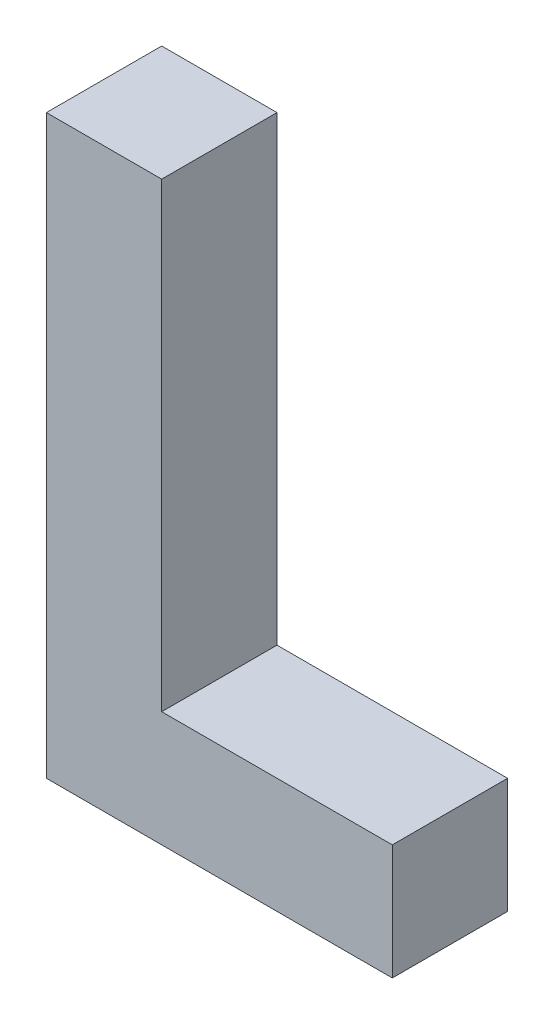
ISO-10303-21;
HEADER;
FILE_DESCRIPTION(('STEP AP214'),'2;1');
FILE_NAME('part.step','',(''),(''),'','','');
FILE_SCHEMA(('AUTOMOTIVE_DESIGN { 1 0 10303 214 1 1 1 1 }'));
ENDSEC;
DATA;
#1=APPLICATION_CONTEXT('core data for automotive mechanical design processes');
#2=APPLICATION_PROTOCOL_DEFINITION('international standard','automotive_design',2000,#1);
#3=PRODUCT_CONTEXT('',#1,'mechanical');
#4=PRODUCT('Part','Part','',(#3));
#5=PRODUCT_RELATED_PRODUCT_CATEGORY('part','',(#4));
#6=PRODUCT_DEFINITION_FORMATION('','',#4);
#7=PRODUCT_DEFINITION_CONTEXT('part definition',#1,'design');
#8=PRODUCT_DEFINITION('design','',#6,#7);
#9=PRODUCT_DEFINITION_SHAPE('','',#8);
#10=(LENGTH_UNIT() NAMED_UNIT(*) SI_UNIT(.MILLI.,.METRE.));
#11=(NAMED_UNIT(*) PLANE_ANGLE_UNIT() SI_UNIT($,.RADIAN.));
#12=(NAMED_UNIT(*) SI_UNIT($,.STERADIAN.) SOLID_ANGLE_UNIT());
#13=UNCERTAINTY_MEASURE_WITH_UNIT(LENGTH_MEASURE(1.E-05),#10,'distance_accuracy_value','');
#14=(GEOMETRIC_REPRESENTATION_CONTEXT(3) GLOBAL_UNCERTAINTY_ASSIGNED_CONTEXT((#13)) GLOBAL_UNIT_ASSIGNED_CONTEXT((#10,
#11,#12)) REPRESENTATION_CONTEXT('',''));
#15=CARTESIAN_POINT('',(0.,0.,0.));
#16=DIRECTION('',(0.,0.,1.));
#17=DIRECTION('',(1.,0.,0.));
#18=AXIS2_PLACEMENT_3D('',#15,#16,#17);
#19=CARTESIAN_POINT('',(0.,0.,10.));
#20=DIRECTION('',(0.,1.,0.));
#21=DIRECTION('',(0.,0.,1.));
#22=AXIS2_PLACEMENT_3D('',#19,#20,#21);
#23=PLANE('',#22);
#24=DIRECTION('',(1.,0.,0.));
#25=VECTOR('',#24,1.);
#26=CARTESIAN_POINT('',(0.,0.,0.));
#27=LINE('',#26,#25);
#28=CARTESIAN_POINT('',(0.,0.,0.));
#29=VERTEX_POINT('',#28);
#30=CARTESIAN_POINT('',(30.,0.,0.));
#31=VERTEX_POINT('',#30);
#32=EDGE_CURVE('E121',#29,#31,#27,.T.);
#33=ORIENTED_EDGE('',*,*,#32,.T.);
#34=DIRECTION('',(0.,0.,-1.));
#35=VECTOR('',#34,1.);
#36=CARTESIAN_POINT('',(30.,0.,10.));
#37=LINE('',#36,#35);
#38=CARTESIAN_POINT('',(30.,0.,10.));
#39=VERTEX_POINT('',#38);
#40=EDGE_CURVE('E41',#39,#31,#37,.T.);
#41=ORIENTED_EDGE('',*,*,#40,.F.);
#42=DIRECTION('',(1.,0.,0.));
#43=VECTOR('',#42,1.);
#44=CARTESIAN_POINT('',(0.,0.,10.));
#45=LINE('',#44,#43);
#46=CARTESIAN_POINT('',(0.,0.,10.));
#47=VERTEX_POINT('',#46);
#48=EDGE_CURVE('E87',#47,#39,#45,.T.);
#49=ORIENTED_EDGE('',*,*,#48,.F.);
#50=DIRECTION('',(0.,0.,-1.));
#51=VECTOR('',#50,1.);
#52=CARTESIAN_POINT('',(0.,0.,10.));
#53=LINE('',#52,#51);
#54=EDGE_CURVE('E11',#47,#29,#53,.T.);
#55=ORIENTED_EDGE('',*,*,#54,.T.);
#56=EDGE_LOOP('',(#33,#41,#49,#55));
#57=FACE_BOUND('',#56,.T.);
#58=ADVANCED_FACE('F33',(#57),#23,.F.);
#59=CARTESIAN_POINT('',(30.,0.,10.));
#60=DIRECTION('',(-1.,0.,0.));
#61=DIRECTION('',(0.,0.,1.));
#62=AXIS2_PLACEMENT_3D('',#59,#60,#61);
#63=PLANE('',#62);
#64=DIRECTION('',(0.,1.,0.));
#65=VECTOR('',#64,1.);
#66=CARTESIAN_POINT('',(30.,0.,0.));
#67=LINE('',#66,#65);
#68=CARTESIAN_POINT('',(30.,10.,0.));
#69=VERTEX_POINT('',#68);
#70=EDGE_CURVE('E123',#31,#69,#67,.T.);
#71=ORIENTED_EDGE('',*,*,#70,.T.);
#72=DIRECTION('',(0.,0.,-1.));
#73=VECTOR('',#72,1.);
#74=CARTESIAN_POINT('',(30.,10.,10.));
#75=LINE('',#74,#73);
#76=CARTESIAN_POINT('',(30.,10.,10.));
#77=VERTEX_POINT('',#76);
#78=EDGE_CURVE('E110',#77,#69,#75,.T.);
#79=ORIENTED_EDGE('',*,*,#78,.F.);
#80=DIRECTION('',(0.,1.,0.));
#81=VECTOR('',#80,1.);
#82=CARTESIAN_POINT('',(30.,0.,10.));
#83=LINE('',#82,#81);
#84=EDGE_CURVE('E101',#39,#77,#83,.T.);
#85=ORIENTED_EDGE('',*,*,#84,.F.);
#86=ORIENTED_EDGE('',*,*,#40,.T.);
#87=EDGE_LOOP('',(#71,#79,#85,#86));
#88=FACE_BOUND('',#87,.T.);
#89=ADVANCED_FACE('F135',(#88),#63,.F.);
#90=CARTESIAN_POINT('',(10.,10.,10.));
#91=DIRECTION('',(0.,-1.,0.));
#92=DIRECTION('',(0.,0.,-1.));
#93=AXIS2_PLACEMENT_3D('',#90,#91,#92);
#94=PLANE('',#93);
#95=DIRECTION('',(-1.,0.,0.));
#96=VECTOR('',#95,1.);
#97=CARTESIAN_POINT('',(10.,10.,0.));
#98=LINE('',#97,#96);
#99=CARTESIAN_POINT('',(10.,10.,0.));
#100=VERTEX_POINT('',#99);
#101=EDGE_CURVE('E109',#69,#100,#98,.T.);
#102=ORIENTED_EDGE('',*,*,#101,.T.);
#103=DIRECTION('',(0.,0.,-1.));
#104=VECTOR('',#103,1.);
#105=CARTESIAN_POINT('',(10.,10.,10.));
#106=LINE('',#105,#104);
#107=CARTESIAN_POINT('',(10.,10.,10.));
#108=VERTEX_POINT('',#107);
#109=EDGE_CURVE('E106',#108,#100,#106,.T.);
#110=ORIENTED_EDGE('',*,*,#109,.F.);
#111=DIRECTION('',(-1.,0.,0.));
#112=VECTOR('',#111,1.);
#113=CARTESIAN_POINT('',(10.,10.,10.));
#114=LINE('',#113,#112);
#115=EDGE_CURVE('E95',#77,#108,#114,.T.);
#116=ORIENTED_EDGE('',*,*,#115,.F.);
#117=ORIENTED_EDGE('',*,*,#78,.T.);
#118=EDGE_LOOP('',(#102,#110,#116,#117));
#119=FACE_BOUND('',#118,.T.);
#120=ADVANCED_FACE('F107',(#119),#94,.F.);
#121=CARTESIAN_POINT('',(10.,10.,10.));
#122=DIRECTION('',(-1.,0.,0.));
#123=DIRECTION('',(0.,0.,1.));
#124=AXIS2_PLACEMENT_3D('',#121,#122,#123);
#125=PLANE('',#124);
#126=DIRECTION('',(0.,1.,0.));
#127=VECTOR('',#126,1.);
#128=CARTESIAN_POINT('',(10.,10.,0.));
#129=LINE('',#128,#127);
#130=CARTESIAN_POINT('',(10.,50.,0.));
#131=VERTEX_POINT('',#130);
#132=EDGE_CURVE('E73',#100,#131,#129,.T.);
#133=ORIENTED_EDGE('',*,*,#132,.T.);
#134=DIRECTION('',(0.,0.,-1.));
#135=VECTOR('',#134,1.);
#136=CARTESIAN_POINT('',(10.,50.,10.));
#137=LINE('',#136,#135);
#138=CARTESIAN_POINT('',(10.,50.,10.));
#139=VERTEX_POINT('',#138);
#140=EDGE_CURVE('E111',#139,#131,#137,.T.);
#141=ORIENTED_EDGE('',*,*,#140,.F.);
#142=DIRECTION('',(0.,1.,0.));
#143=VECTOR('',#142,1.);
#144=CARTESIAN_POINT('',(10.,10.,10.));
#145=LINE('',#144,#143);
#146=EDGE_CURVE('E99',#108,#139,#145,.T.);
#147=ORIENTED_EDGE('',*,*,#146,.F.);
#148=ORIENTED_EDGE('',*,*,#109,.T.);
#149=EDGE_LOOP('',(#133,#141,#147,#148));
#150=FACE_BOUND('',#149,.T.);
#151=ADVANCED_FACE('F113',(#150),#125,.F.);
#152=CARTESIAN_POINT('',(0.,50.,10.));
#153=DIRECTION('',(0.,-1.,0.));
#154=DIRECTION('',(0.,0.,-1.));
#155=AXIS2_PLACEMENT_3D('',#152,#153,#154);
#156=PLANE('',#155);
#157=DIRECTION('',(-1.,0.,0.));
#158=VECTOR('',#157,1.);
#159=CARTESIAN_POINT('',(0.,50.,0.));
#160=LINE('',#159,#158);
#161=CARTESIAN_POINT('',(0.,50.,0.));
#162=VERTEX_POINT('',#161);
#163=EDGE_CURVE('E80',#131,#162,#160,.T.);
#164=ORIENTED_EDGE('',*,*,#163,.T.);
#165=DIRECTION('',(0.,0.,-1.));
#166=VECTOR('',#165,1.);
#167=CARTESIAN_POINT('',(0.,50.,10.));
#168=LINE('',#167,#166);
#169=CARTESIAN_POINT('',(0.,50.,10.));
#170=VERTEX_POINT('',#169);
#171=EDGE_CURVE('E117',#170,#162,#168,.T.);
#172=ORIENTED_EDGE('',*,*,#171,.F.);
#173=DIRECTION('',(-1.,0.,0.));
#174=VECTOR('',#173,1.);
#175=CARTESIAN_POINT('',(0.,50.,10.));
#176=LINE('',#175,#174);
#177=EDGE_CURVE('E115',#139,#170,#176,.T.);
#178=ORIENTED_EDGE('',*,*,#177,.F.);
#179=ORIENTED_EDGE('',*,*,#140,.T.);
#180=EDGE_LOOP('',(#164,#172,#178,#179));
#181=FACE_BOUND('',#180,.T.);
#182=ADVANCED_FACE('F141',(#181),#156,.F.);
#183=CARTESIAN_POINT('',(0.,10.,10.));
#184=DIRECTION('',(1.,0.,0.));
#185=DIRECTION('',(0.,0.,-1.));
#186=AXIS2_PLACEMENT_3D('',#183,#184,#185);
#187=PLANE('',#186);
#188=DIRECTION('',(0.,-1.,0.));
#189=VECTOR('',#188,1.);
#190=CARTESIAN_POINT('',(0.,10.,0.));
#191=LINE('',#190,#189);
#192=EDGE_CURVE('E128',#162,#29,#191,.T.);
#193=ORIENTED_EDGE('',*,*,#192,.T.);
#194=ORIENTED_EDGE('',*,*,#54,.F.);
#195=DIRECTION('',(0.,-1.,0.));
#196=VECTOR('',#195,1.);
#197=CARTESIAN_POINT('',(0.,0.,10.));
#198=LINE('',#197,#196);
#199=EDGE_CURVE('E49',#170,#47,#198,.T.);
#200=ORIENTED_EDGE('',*,*,#199,.F.);
#201=ORIENTED_EDGE('',*,*,#171,.T.);
#202=EDGE_LOOP('',(#193,#194,#200,#201));
#203=FACE_BOUND('',#202,.T.);
#204=ADVANCED_FACE('F140',(#203),#187,.F.);
#205=CARTESIAN_POINT('',(0.,0.,10.));
#206=DIRECTION('',(0.,0.,-1.));
#207=DIRECTION('',(-1.,0.,0.));
#208=AXIS2_PLACEMENT_3D('',#205,#206,#207);
#209=PLANE('',#208);
#210=ORIENTED_EDGE('',*,*,#199,.T.);
#211=ORIENTED_EDGE('',*,*,#48,.T.);
#212=ORIENTED_EDGE('',*,*,#84,.T.);
#213=ORIENTED_EDGE('',*,*,#115,.T.);
#214=ORIENTED_EDGE('',*,*,#146,.T.);
#215=ORIENTED_EDGE('',*,*,#177,.T.);
#216=EDGE_LOOP('',(#210,#211,#212,#213,#214,#215));
#217=FACE_BOUND('',#216,.T.);
#218=ADVANCED_FACE('F97',(#217),#209,.F.);
#219=CARTESIAN_POINT('',(0.,0.,0.));
#220=DIRECTION('',(0.,0.,-1.));
#221=DIRECTION('',(-1.,0.,0.));
#222=AXIS2_PLACEMENT_3D('',#219,#220,#221);
#223=PLANE('',#222);
#224=ORIENTED_EDGE('',*,*,#32,.F.);
#225=ORIENTED_EDGE('',*,*,#192,.F.);
#226=ORIENTED_EDGE('',*,*,#163,.F.);
#227=ORIENTED_EDGE('',*,*,#132,.F.);
#228=ORIENTED_EDGE('',*,*,#101,.F.);
#229=ORIENTED_EDGE('',*,*,#70,.F.);
#230=EDGE_LOOP('',(#224,#225,#226,#227,#228,#229));
#231=FACE_BOUND('',#230,.T.);
#232=ADVANCED_FACE('F138',(#231),#223,.T.);
#233=CLOSED_SHELL('',(#58,#89,#120,#151,#182,#204,#218,#232));
#234=MANIFOLD_SOLID_BREP('B2',#233);
#235=ADVANCED_BREP_SHAPE_REPRESENTATION('',(#18,#234),#14);
#236=SHAPE_DEFINITION_REPRESENTATION(#9,#235);
ENDSEC;
END-ISO-10303-21;
